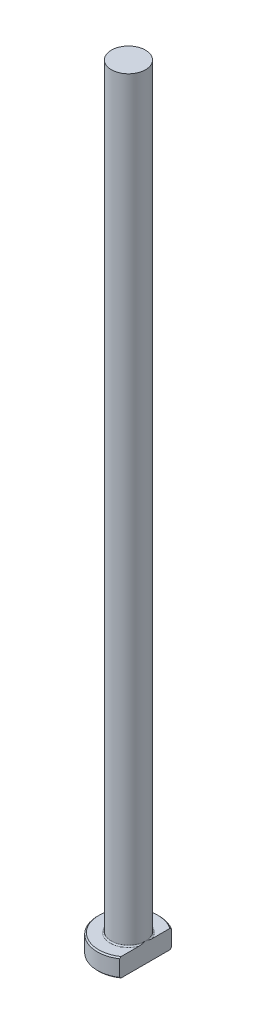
ISO-10303-21;
HEADER;
FILE_DESCRIPTION(('STEP AP214'),'2;1');
FILE_NAME('part.step','',(''),(''),'','','');
FILE_SCHEMA(('AUTOMOTIVE_DESIGN { 1 0 10303 214 1 1 1 1 }'));
ENDSEC;
DATA;
#1=APPLICATION_CONTEXT('core data for automotive mechanical design processes');
#2=APPLICATION_PROTOCOL_DEFINITION('international standard','automotive_design',2000,#1);
#3=PRODUCT_CONTEXT('',#1,'mechanical');
#4=PRODUCT('Part','Part','',(#3));
#5=PRODUCT_RELATED_PRODUCT_CATEGORY('part','',(#4));
#6=PRODUCT_DEFINITION_FORMATION('','',#4);
#7=PRODUCT_DEFINITION_CONTEXT('part definition',#1,'design');
#8=PRODUCT_DEFINITION('design','',#6,#7);
#9=PRODUCT_DEFINITION_SHAPE('','',#8);
#10=(LENGTH_UNIT() NAMED_UNIT(*) SI_UNIT(.MILLI.,.METRE.));
#11=(NAMED_UNIT(*) PLANE_ANGLE_UNIT() SI_UNIT($,.RADIAN.));
#12=(NAMED_UNIT(*) SI_UNIT($,.STERADIAN.) SOLID_ANGLE_UNIT());
#13=UNCERTAINTY_MEASURE_WITH_UNIT(LENGTH_MEASURE(1.E-05),#10,'distance_accuracy_value','');
#14=(GEOMETRIC_REPRESENTATION_CONTEXT(3) GLOBAL_UNCERTAINTY_ASSIGNED_CONTEXT((#13)) GLOBAL_UNIT_ASSIGNED_CONTEXT((#10,
#11,#12)) REPRESENTATION_CONTEXT('',''));
#15=CARTESIAN_POINT('',(0.,0.,0.));
#16=DIRECTION('',(0.,0.,1.));
#17=DIRECTION('',(1.,0.,0.));
#18=AXIS2_PLACEMENT_3D('',#15,#16,#17);
#19=CARTESIAN_POINT('',(0.,0.,0.));
#20=DIRECTION('',(0.,-1.,0.));
#21=DIRECTION('',(0.,0.,-1.));
#22=AXIS2_PLACEMENT_3D('',#19,#20,#21);
#23=PLANE('',#22);
#24=CARTESIAN_POINT('',(0.,0.,0.));
#25=DIRECTION('',(0.,-1.,0.));
#26=DIRECTION('',(0.,0.,-1.));
#27=AXIS2_PLACEMENT_3D('',#24,#25,#26);
#28=CIRCLE('',#27,4.79999999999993);
#29=CARTESIAN_POINT('',(2.74999999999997,0.,3.93414539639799));
#30=VERTEX_POINT('',#29);
#31=CARTESIAN_POINT('',(2.74999999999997,0.,-3.93414539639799));
#32=VERTEX_POINT('',#31);
#33=EDGE_CURVE('E98',#30,#32,#28,.T.);
#34=ORIENTED_EDGE('',*,*,#33,.T.);
#35=DIRECTION('',(0.,0.,1.));
#36=VECTOR('',#35,1.);
#37=CARTESIAN_POINT('',(2.74999999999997,0.,-4.1758232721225));
#38=LINE('',#37,#36);
#39=EDGE_CURVE('E83',#32,#30,#38,.T.);
#40=ORIENTED_EDGE('',*,*,#39,.T.);
#41=EDGE_LOOP('',(#34,#40));
#42=FACE_BOUND('',#41,.T.);
#43=ADVANCED_FACE('F32',(#42),#23,.T.);
#44=CARTESIAN_POINT('',(0.,259.958771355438,0.));
#45=DIRECTION('',(0.,1.,0.));
#46=DIRECTION('',(0.,0.,1.));
#47=AXIS2_PLACEMENT_3D('',#44,#45,#46);
#48=CYLINDRICAL_SURFACE('',#47,4.99999999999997);
#49=CARTESIAN_POINT('',(0.,2.80000000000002,0.));
#50=DIRECTION('',(0.,1.,0.));
#51=DIRECTION('',(0.,0.,1.));
#52=AXIS2_PLACEMENT_3D('',#49,#50,#51);
#53=CIRCLE('',#52,4.99999999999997);
#54=CARTESIAN_POINT('',(2.74999999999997,2.80000000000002,4.1758232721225));
#55=VERTEX_POINT('',#54);
#56=CARTESIAN_POINT('',(2.74999999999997,2.80000000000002,-4.1758232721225));
#57=VERTEX_POINT('',#56);
#58=EDGE_CURVE('E104',#55,#57,#53,.F.);
#59=ORIENTED_EDGE('',*,*,#58,.T.);
#60=DIRECTION('',(0.,-1.,0.));
#61=VECTOR('',#60,1.);
#62=CARTESIAN_POINT('',(2.74999999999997,125.,-4.1758232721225));
#63=LINE('',#62,#61);
#64=CARTESIAN_POINT('',(2.74999999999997,0.200000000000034,-4.1758232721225));
#65=VERTEX_POINT('',#64);
#66=EDGE_CURVE('E183',#57,#65,#63,.T.);
#67=ORIENTED_EDGE('',*,*,#66,.T.);
#68=CARTESIAN_POINT('',(0.,0.200000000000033,0.));
#69=DIRECTION('',(0.,-1.,0.));
#70=DIRECTION('',(0.,0.,-1.));
#71=AXIS2_PLACEMENT_3D('',#68,#69,#70);
#72=CIRCLE('',#71,4.99999999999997);
#73=CARTESIAN_POINT('',(2.74999999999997,0.200000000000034,4.1758232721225));
#74=VERTEX_POINT('',#73);
#75=EDGE_CURVE('E100',#65,#74,#72,.F.);
#76=ORIENTED_EDGE('',*,*,#75,.T.);
#77=DIRECTION('',(0.,-1.,0.));
#78=VECTOR('',#77,1.);
#79=CARTESIAN_POINT('',(2.74999999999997,125.,4.1758232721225));
#80=LINE('',#79,#78);
#81=EDGE_CURVE('E93',#55,#74,#80,.T.);
#82=ORIENTED_EDGE('',*,*,#81,.F.);
#83=EDGE_LOOP('',(#59,#67,#76,#82));
#84=FACE_BOUND('',#83,.T.);
#85=ADVANCED_FACE('F158',(#84),#48,.T.);
#86=CARTESIAN_POINT('',(-4.99999999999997,3.,0.));
#87=DIRECTION('',(0.,1.,0.));
#88=DIRECTION('',(0.,0.,1.));
#89=AXIS2_PLACEMENT_3D('',#86,#87,#88);
#90=PLANE('',#89);
#91=CARTESIAN_POINT('',(0.,3.,0.));
#92=DIRECTION('',(0.,1.,0.));
#93=DIRECTION('',(0.,0.,1.));
#94=AXIS2_PLACEMENT_3D('',#91,#92,#93);
#95=CIRCLE('',#94,4.79999999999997);
#96=CARTESIAN_POINT('',(2.74999999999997,3.,-3.93414539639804));
#97=VERTEX_POINT('',#96);
#98=CARTESIAN_POINT('',(2.74999999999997,3.,3.93414539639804));
#99=VERTEX_POINT('',#98);
#100=EDGE_CURVE('E178',#97,#99,#95,.T.);
#101=ORIENTED_EDGE('',*,*,#100,.T.);
#102=DIRECTION('',(0.,0.,-1.));
#103=VECTOR('',#102,1.);
#104=CARTESIAN_POINT('',(2.74999999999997,3.,0.));
#105=LINE('',#104,#103);
#106=CARTESIAN_POINT('',(2.74999999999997,2.99999999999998,1.06770782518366));
#107=VERTEX_POINT('',#106);
#108=EDGE_CURVE('E57',#99,#107,#105,.T.);
#109=ORIENTED_EDGE('',*,*,#108,.T.);
#110=CARTESIAN_POINT('',(0.,3.,0.));
#111=DIRECTION('',(0.,1.,0.));
#112=DIRECTION('',(0.,0.,1.));
#113=AXIS2_PLACEMENT_3D('',#110,#111,#112);
#114=CIRCLE('',#113,2.94999999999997);
#115=CARTESIAN_POINT('',(2.74999999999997,2.99999999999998,-1.06770782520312));
#116=VERTEX_POINT('',#115);
#117=EDGE_CURVE('E107',#107,#116,#114,.F.);
#118=ORIENTED_EDGE('',*,*,#117,.T.);
#119=EDGE_CURVE('E136',#116,#97,#105,.T.);
#120=ORIENTED_EDGE('',*,*,#119,.T.);
#121=EDGE_LOOP('',(#101,#109,#118,#120));
#122=FACE_BOUND('',#121,.T.);
#123=ADVANCED_FACE('F147',(#122),#90,.T.);
#124=CARTESIAN_POINT('',(0.,3.,0.));
#125=DIRECTION('',(0.,-1.,0.));
#126=DIRECTION('',(0.,0.,-1.));
#127=AXIS2_PLACEMENT_3D('',#124,#125,#126);
#128=CONICAL_SURFACE('',#127,4.79999999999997,0.785398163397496);
#129=ORIENTED_EDGE('',*,*,#58,.F.);
#130=CARTESIAN_POINT('',(2.74999999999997,-1.79114558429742,9.18844783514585));
#131=CARTESIAN_POINT('',(2.74999999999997,-1.62476324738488,9.0147689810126));
#132=CARTESIAN_POINT('',(2.74999999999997,-1.45857819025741,8.84090089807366));
#133=CARTESIAN_POINT('',(2.74999999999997,-1.12668775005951,8.49270511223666));
#134=CARTESIAN_POINT('',(2.74999999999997,-0.960982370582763,8.31837740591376));
#135=CARTESIAN_POINT('',(2.74999999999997,-0.464632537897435,7.79449769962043));
#136=CARTESIAN_POINT('',(2.74999999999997,-0.13483958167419,7.44413786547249));
#137=CARTESIAN_POINT('',(2.74999999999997,0.521406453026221,6.74030951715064));
#138=CARTESIAN_POINT('',(2.74999999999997,0.847859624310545,6.38684108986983));
#139=CARTESIAN_POINT('',(2.74999999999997,1.33353933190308,5.85303151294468));
#140=CARTESIAN_POINT('',(2.74999999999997,1.49475728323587,5.67450358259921));
#141=CARTESIAN_POINT('',(2.74999999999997,1.8154555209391,5.31589537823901));
#142=CARTESIAN_POINT('',(2.74999999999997,1.97493583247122,5.13581512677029));
#143=CARTESIAN_POINT('',(2.74999999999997,2.28246157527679,4.78409714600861));
#144=CARTESIAN_POINT('',(2.74999999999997,2.43063567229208,4.6125721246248));
#145=CARTESIAN_POINT('',(2.74999999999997,2.72427023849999,4.26717959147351));
#146=CARTESIAN_POINT('',(2.74999999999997,2.86973045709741,4.09331186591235));
#147=CARTESIAN_POINT('',(2.74999999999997,3.15716227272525,3.74214491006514));
#148=CARTESIAN_POINT('',(2.74999999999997,3.29912659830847,3.56483970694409));
#149=CARTESIAN_POINT('',(2.74999999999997,3.57763983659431,3.20603939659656));
#150=CARTESIAN_POINT('',(2.74999999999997,3.7141898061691,3.02454511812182));
#151=CARTESIAN_POINT('',(2.74999999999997,3.93857405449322,2.71219163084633));
#152=CARTESIAN_POINT('',(2.74999999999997,4.02851673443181,2.58285434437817));
#153=CARTESIAN_POINT('',(2.74999999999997,4.20308451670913,2.3205424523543));
#154=CARTESIAN_POINT('',(2.74999999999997,4.28770764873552,2.18756652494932));
#155=CARTESIAN_POINT('',(2.74999999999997,4.44931959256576,1.91735675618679));
#156=CARTESIAN_POINT('',(2.74999999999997,4.52632375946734,1.7801322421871));
#157=CARTESIAN_POINT('',(2.74999999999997,4.66966790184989,1.50031327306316));
#158=CARTESIAN_POINT('',(2.74999999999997,4.73601725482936,1.35772367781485));
#159=CARTESIAN_POINT('',(2.74999999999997,4.86065113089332,1.04856386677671));
#160=CARTESIAN_POINT('',(2.74999999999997,4.91700799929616,0.881171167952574));
#161=CARTESIAN_POINT('',(2.74999999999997,4.9810280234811,0.625229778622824));
#162=CARTESIAN_POINT('',(2.74999999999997,4.99893817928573,0.539229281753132));
#163=CARTESIAN_POINT('',(2.74999999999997,5.02707157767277,0.365959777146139));
#164=CARTESIAN_POINT('',(2.74999999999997,5.03729562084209,0.278690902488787));
#165=CARTESIAN_POINT('',(2.74999999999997,5.04949232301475,0.102763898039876));
#166=CARTESIAN_POINT('',(2.74999999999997,5.05138838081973,0.0141003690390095));
#167=CARTESIAN_POINT('',(2.74999999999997,5.04659669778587,-0.16299024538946));
#168=CARTESIAN_POINT('',(2.74999999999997,5.03990892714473,-0.25141732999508));
#169=CARTESIAN_POINT('',(2.74999999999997,5.01835539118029,-0.427430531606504));
#170=CARTESIAN_POINT('',(2.74999999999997,5.00347341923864,-0.51501463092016));
#171=CARTESIAN_POINT('',(2.74999999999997,4.96636720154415,-0.688602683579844));
#172=CARTESIAN_POINT('',(2.74999999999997,4.94414138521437,-0.774606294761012));
#173=CARTESIAN_POINT('',(2.74999999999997,4.88037969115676,-0.988315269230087));
#174=CARTESIAN_POINT('',(2.74999999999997,4.8347849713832,-1.11480587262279));
#175=CARTESIAN_POINT('',(2.74999999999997,4.73271903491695,-1.36329985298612));
#176=CARTESIAN_POINT('',(2.74999999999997,4.67623944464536,-1.48529968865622));
#177=CARTESIAN_POINT('',(2.74999999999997,4.55498227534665,-1.72582737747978));
#178=CARTESIAN_POINT('',(2.74999999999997,4.49016436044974,-1.84433466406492));
#179=CARTESIAN_POINT('',(2.74999999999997,4.38849038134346,-2.01944141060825));
#180=CARTESIAN_POINT('',(2.74999999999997,4.35386385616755,-2.07735876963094));
#181=CARTESIAN_POINT('',(2.74999999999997,4.28331846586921,-2.19239883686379));
#182=CARTESIAN_POINT('',(2.74999999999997,4.24739965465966,-2.24952157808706));
#183=CARTESIAN_POINT('',(2.74999999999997,4.12488368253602,-2.44019263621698));
#184=CARTESIAN_POINT('',(2.74999999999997,4.03574833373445,-2.57211125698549));
#185=CARTESIAN_POINT('',(2.74999999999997,3.85300432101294,-2.83282496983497));
#186=CARTESIAN_POINT('',(2.74999999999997,3.75939460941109,-2.96161931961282));
#187=CARTESIAN_POINT('',(2.74999999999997,3.56878484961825,-3.21681212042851));
#188=CARTESIAN_POINT('',(2.74999999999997,3.47178237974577,-3.34320875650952));
#189=CARTESIAN_POINT('',(2.74999999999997,3.27524323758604,-3.59402090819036));
#190=CARTESIAN_POINT('',(2.74999999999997,3.17570641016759,-3.71843630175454));
#191=CARTESIAN_POINT('',(2.74999999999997,2.97442282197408,-3.96596722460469));
#192=CARTESIAN_POINT('',(2.74999999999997,2.87267126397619,-4.08907884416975));
#193=CARTESIAN_POINT('',(2.74999999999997,2.66760125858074,-4.3339916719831));
#194=CARTESIAN_POINT('',(2.74999999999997,2.56428277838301,-4.45579285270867));
#195=CARTESIAN_POINT('',(2.74999999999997,2.25255029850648,-4.81947940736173));
#196=CARTESIAN_POINT('',(2.74999999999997,2.04226620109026,-5.05976099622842));
#197=CARTESIAN_POINT('',(2.74999999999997,1.61812846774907,-5.5376054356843));
#198=CARTESIAN_POINT('',(2.74999999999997,1.40427119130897,-5.77516503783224));
#199=CARTESIAN_POINT('',(2.74999999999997,0.974157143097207,-6.24814387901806));
#200=CARTESIAN_POINT('',(2.74999999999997,0.757900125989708,-6.48356289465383));
#201=CARTESIAN_POINT('',(2.74999999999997,0.323911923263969,-6.95249982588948));
#202=CARTESIAN_POINT('',(2.74999999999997,0.106182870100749,-7.186019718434));
#203=CARTESIAN_POINT('',(2.74999999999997,-0.330587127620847,-7.65182952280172));
#204=CARTESIAN_POINT('',(2.74999999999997,-0.549628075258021,-7.88411943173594));
#205=CARTESIAN_POINT('',(2.74999999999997,-0.854135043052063,-8.20563072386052));
#206=CARTESIAN_POINT('',(2.74999999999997,-0.939169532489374,-8.29526139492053));
#207=CARTESIAN_POINT('',(2.74999999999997,-1.10939110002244,-8.47440444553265));
#208=CARTESIAN_POINT('',(2.74999999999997,-1.19457819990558,-8.56391680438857));
#209=CARTESIAN_POINT('',(2.74999999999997,-1.36493542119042,-8.74266965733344));
#210=CARTESIAN_POINT('',(2.74999999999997,-1.45010532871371,-8.83191035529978));
#211=CARTESIAN_POINT('',(2.74999999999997,-1.62054776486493,-9.01026683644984));
#212=CARTESIAN_POINT('',(2.74999999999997,-1.70582027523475,-9.09938263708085));
#213=CARTESIAN_POINT('',(2.74999999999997,-1.79114558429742,-9.18844783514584));
#214=B_SPLINE_CURVE_WITH_KNOTS('',3,(#130,#131,#132,#133,#134,#135,#136,#137,#138,#139,#140,
#141,#142,#143,#144,#145,#146,#147,#148,#149,#150,#151,#152,#153,#154,#155,#156,#157,#158,#159,
#160,#161,#162,#163,#164,#165,#166,#167,#168,#169,#170,#171,#172,#173,#174,#175,#176,#177,#178,
#179,#180,#181,#182,#183,#184,#185,#186,#187,#188,#189,#190,#191,#192,#193,#194,#195,#196,#197,
#198,#199,#200,#201,#202,#203,#204,#205,#206,#207,#208,#209,#210,#211,#212,#213),.UNSPECIFIED.,
.F.,.F.,(4,2,2,2,2,2,2,2,2,2,2,2,2,2,2,2,2,2,2,2,2,2,2,2,2,2,2,2,2,2,2,2,2,2,2,2,2,2,2,2,2,4),
(0.,0.721544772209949,1.4430949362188,2.88656432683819,4.32999349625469,5.05163004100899,
5.77325612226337,6.45322671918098,7.13325979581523,7.81460476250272,8.49581607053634,
8.96833065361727,9.4410192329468,9.91273488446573,10.3840330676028,10.9119743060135,
11.1752192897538,11.4384368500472,11.7040704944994,11.9697050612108,12.2358669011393,
12.5020857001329,12.9047274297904,13.3076801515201,13.712661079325,13.9150857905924,
14.1175020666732,14.5949844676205,15.0725792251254,15.5505221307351,16.0284943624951,
16.5076321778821,16.9867800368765,17.94463622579,18.9035363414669,19.862535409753,
20.8203587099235,21.7781842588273,22.1488332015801,22.5195401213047,22.889621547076,
23.259644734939),.UNSPECIFIED.);
#215=EDGE_CURVE('E135',#55,#99,#214,.T.);
#216=ORIENTED_EDGE('',*,*,#215,.T.);
#217=ORIENTED_EDGE('',*,*,#100,.F.);
#218=EDGE_CURVE('E127',#97,#57,#214,.T.);
#219=ORIENTED_EDGE('',*,*,#218,.T.);
#220=EDGE_LOOP('',(#129,#216,#217,#219));
#221=FACE_BOUND('',#220,.T.);
#222=ADVANCED_FACE('F143',(#221),#128,.T.);
#223=CARTESIAN_POINT('',(0.,0.200000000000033,0.));
#224=DIRECTION('',(0.,1.,0.));
#225=DIRECTION('',(0.,0.,1.));
#226=AXIS2_PLACEMENT_3D('',#223,#224,#225);
#227=CONICAL_SURFACE('',#226,4.99999999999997,0.785398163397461);
#228=ORIENTED_EDGE('',*,*,#75,.F.);
#229=CARTESIAN_POINT('',(2.74999999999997,4.7911455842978,-9.18844783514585));
#230=CARTESIAN_POINT('',(2.74999999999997,4.62476324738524,-9.0147689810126));
#231=CARTESIAN_POINT('',(2.74999999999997,4.45857819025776,-8.84090089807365));
#232=CARTESIAN_POINT('',(2.74999999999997,4.12668775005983,-8.49270511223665));
#233=CARTESIAN_POINT('',(2.74999999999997,3.96098237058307,-8.31837740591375));
#234=CARTESIAN_POINT('',(2.74999999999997,3.4646325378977,-7.79449769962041));
#235=CARTESIAN_POINT('',(2.74999999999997,3.13483958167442,-7.44413786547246));
#236=CARTESIAN_POINT('',(2.74999999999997,2.47859354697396,-6.7403095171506));
#237=CARTESIAN_POINT('',(2.74999999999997,2.15214037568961,-6.38684108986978));
#238=CARTESIAN_POINT('',(2.74999999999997,1.66646066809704,-5.85303151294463));
#239=CARTESIAN_POINT('',(2.74999999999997,1.50524271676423,-5.67450358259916));
#240=CARTESIAN_POINT('',(2.74999999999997,1.18454447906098,-5.31589537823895));
#241=CARTESIAN_POINT('',(2.74999999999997,1.02506416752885,-5.13581512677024));
#242=CARTESIAN_POINT('',(2.74999999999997,0.717538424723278,-4.78409714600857));
#243=CARTESIAN_POINT('',(2.74999999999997,0.569364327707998,-4.6125721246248));
#244=CARTESIAN_POINT('',(2.74999999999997,0.275729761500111,-4.26717959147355));
#245=CARTESIAN_POINT('',(2.74999999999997,0.130269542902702,-4.09331186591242));
#246=CARTESIAN_POINT('',(2.74999999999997,-0.157162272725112,-3.74214491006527));
#247=CARTESIAN_POINT('',(2.74999999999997,-0.299126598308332,-3.56483970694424));
#248=CARTESIAN_POINT('',(2.74999999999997,-0.577639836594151,-3.20603939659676));
#249=CARTESIAN_POINT('',(2.74999999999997,-0.714189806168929,-3.02454511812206));
#250=CARTESIAN_POINT('',(2.74999999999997,-0.93857405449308,-2.71219163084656));
#251=CARTESIAN_POINT('',(2.74999999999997,-1.02851673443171,-2.58285434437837));
#252=CARTESIAN_POINT('',(2.74999999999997,-1.20308451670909,-2.32054245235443));
#253=CARTESIAN_POINT('',(2.74999999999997,-1.2877076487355,-2.18756652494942));
#254=CARTESIAN_POINT('',(2.74999999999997,-1.4493195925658,-1.91735675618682));
#255=CARTESIAN_POINT('',(2.74999999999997,-1.52632375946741,-1.78013224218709));
#256=CARTESIAN_POINT('',(2.74999999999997,-1.66966790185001,-1.50031327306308));
#257=CARTESIAN_POINT('',(2.74999999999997,-1.73601725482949,-1.35772367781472));
#258=CARTESIAN_POINT('',(2.74999999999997,-1.86065113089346,-1.04856386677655));
#259=CARTESIAN_POINT('',(2.74999999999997,-1.91700799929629,-0.881171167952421));
#260=CARTESIAN_POINT('',(2.74999999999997,-1.98102802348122,-0.625229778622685));
#261=CARTESIAN_POINT('',(2.74999999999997,-1.99893817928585,-0.539229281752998));
#262=CARTESIAN_POINT('',(2.74999999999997,-2.02707157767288,-0.365959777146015));
#263=CARTESIAN_POINT('',(2.74999999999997,-2.0372956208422,-0.278690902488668));
#264=CARTESIAN_POINT('',(2.74999999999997,-2.04949232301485,-0.102763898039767));
#265=CARTESIAN_POINT('',(2.74999999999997,-2.05138838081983,-0.0141003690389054));
#266=CARTESIAN_POINT('',(2.74999999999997,-2.04659669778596,0.162990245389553));
#267=CARTESIAN_POINT('',(2.74999999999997,-2.03990892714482,0.251417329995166));
#268=CARTESIAN_POINT('',(2.74999999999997,-2.01835539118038,0.427430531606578));
#269=CARTESIAN_POINT('',(2.74999999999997,-2.00347341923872,0.515014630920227));
#270=CARTESIAN_POINT('',(2.74999999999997,-1.96636720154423,0.688602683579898));
#271=CARTESIAN_POINT('',(2.74999999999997,-1.94414138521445,0.77460629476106));
#272=CARTESIAN_POINT('',(2.74999999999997,-1.88037969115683,0.988315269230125));
#273=CARTESIAN_POINT('',(2.74999999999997,-1.83478497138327,1.11480587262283));
#274=CARTESIAN_POINT('',(2.74999999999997,-1.73271903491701,1.36329985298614));
#275=CARTESIAN_POINT('',(2.74999999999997,-1.67623944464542,1.48529968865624));
#276=CARTESIAN_POINT('',(2.74999999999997,-1.55498227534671,1.72582737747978));
#277=CARTESIAN_POINT('',(2.74999999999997,-1.4901643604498,1.84433466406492));
#278=CARTESIAN_POINT('',(2.74999999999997,-1.38849038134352,2.01944141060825));
#279=CARTESIAN_POINT('',(2.74999999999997,-1.3538638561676,2.07735876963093));
#280=CARTESIAN_POINT('',(2.74999999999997,-1.28331846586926,2.19239883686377));
#281=CARTESIAN_POINT('',(2.74999999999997,-1.24739965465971,2.24952157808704));
#282=CARTESIAN_POINT('',(2.74999999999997,-1.12488368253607,2.44019263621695));
#283=CARTESIAN_POINT('',(2.74999999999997,-1.0357483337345,2.57211125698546));
#284=CARTESIAN_POINT('',(2.74999999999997,-0.85300432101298,2.83282496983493));
#285=CARTESIAN_POINT('',(2.74999999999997,-0.759394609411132,2.96161931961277));
#286=CARTESIAN_POINT('',(2.74999999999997,-0.568784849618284,3.21681212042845));
#287=CARTESIAN_POINT('',(2.74999999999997,-0.47178237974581,3.34320875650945));
#288=CARTESIAN_POINT('',(2.74999999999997,-0.275243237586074,3.59402090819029));
#289=CARTESIAN_POINT('',(2.74999999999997,-0.17570641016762,3.71843630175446));
#290=CARTESIAN_POINT('',(2.74999999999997,0.0255771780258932,3.9659672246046));
#291=CARTESIAN_POINT('',(2.74999999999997,0.127328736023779,4.08907884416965));
#292=CARTESIAN_POINT('',(2.74999999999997,0.33239874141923,4.33399167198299));
#293=CARTESIAN_POINT('',(2.74999999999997,0.435717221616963,4.45579285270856));
#294=CARTESIAN_POINT('',(2.74999999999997,0.747449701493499,4.8194794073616));
#295=CARTESIAN_POINT('',(2.74999999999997,0.95773379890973,5.05976099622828));
#296=CARTESIAN_POINT('',(2.74999999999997,1.38187153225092,5.53760543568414));
#297=CARTESIAN_POINT('',(2.74999999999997,1.59572880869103,5.77516503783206));
#298=CARTESIAN_POINT('',(2.74999999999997,2.02584285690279,6.24814387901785));
#299=CARTESIAN_POINT('',(2.74999999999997,2.2420998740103,6.48356289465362));
#300=CARTESIAN_POINT('',(2.74999999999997,2.67608807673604,6.95249982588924));
#301=CARTESIAN_POINT('',(2.74999999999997,2.89381712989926,7.18601971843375));
#302=CARTESIAN_POINT('',(2.74999999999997,3.33058712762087,7.65182952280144));
#303=CARTESIAN_POINT('',(2.74999999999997,3.54962807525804,7.88411943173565));
#304=CARTESIAN_POINT('',(2.74999999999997,3.85413504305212,8.20563072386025));
#305=CARTESIAN_POINT('',(2.74999999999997,3.93916953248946,8.29526139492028));
#306=CARTESIAN_POINT('',(2.74999999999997,4.10939110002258,8.47440444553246));
#307=CARTESIAN_POINT('',(2.74999999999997,4.19457819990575,8.5639168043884));
#308=CARTESIAN_POINT('',(2.74999999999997,4.36493542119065,8.74266965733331));
#309=CARTESIAN_POINT('',(2.74999999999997,4.45010532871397,8.83191035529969));
#310=CARTESIAN_POINT('',(2.74999999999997,4.62054776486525,9.0102668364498));
#311=CARTESIAN_POINT('',(2.74999999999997,4.7058202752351,9.09938263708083));
#312=CARTESIAN_POINT('',(2.74999999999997,4.7911455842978,9.18844783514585));
#313=B_SPLINE_CURVE_WITH_KNOTS('',3,(#229,#230,#231,#232,#233,#234,#235,#236,#237,#238,#239,
#240,#241,#242,#243,#244,#245,#246,#247,#248,#249,#250,#251,#252,#253,#254,#255,#256,#257,#258,
#259,#260,#261,#262,#263,#264,#265,#266,#267,#268,#269,#270,#271,#272,#273,#274,#275,#276,#277,
#278,#279,#280,#281,#282,#283,#284,#285,#286,#287,#288,#289,#290,#291,#292,#293,#294,#295,#296,
#297,#298,#299,#300,#301,#302,#303,#304,#305,#306,#307,#308,#309,#310,#311,#312),.UNSPECIFIED.,
.F.,.F.,(4,2,2,2,2,2,2,2,2,2,2,2,2,2,2,2,2,2,2,2,2,2,2,2,2,2,2,2,2,2,2,2,2,2,2,2,2,2,2,2,2,4),
(0.,0.721544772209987,1.44309493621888,2.88656432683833,4.32999349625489,5.05163004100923,
5.77325612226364,6.45322671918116,7.13325979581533,7.81460476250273,8.49581607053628,
8.96833065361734,9.44101923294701,9.91273488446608,10.3840330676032,10.911974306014,
11.1752192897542,11.4384368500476,11.7040704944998,11.9697050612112,12.2358669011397,
12.5020857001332,12.9047274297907,13.3076801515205,13.7126610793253,13.9150857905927,
14.1175020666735,14.5949844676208,15.0725792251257,15.5505221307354,16.0284943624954,
16.5076321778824,16.9867800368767,17.9446362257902,18.9035363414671,19.8625354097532,
20.8203587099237,21.7781842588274,22.1488332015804,22.5195401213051,22.8896215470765,
23.2596447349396),.UNSPECIFIED.);
#314=EDGE_CURVE('E86',#65,#32,#313,.T.);
#315=ORIENTED_EDGE('',*,*,#314,.T.);
#316=ORIENTED_EDGE('',*,*,#33,.F.);
#317=EDGE_CURVE('E89',#30,#74,#313,.T.);
#318=ORIENTED_EDGE('',*,*,#317,.T.);
#319=EDGE_LOOP('',(#228,#315,#316,#318));
#320=FACE_BOUND('',#319,.T.);
#321=ADVANCED_FACE('F97',(#320),#227,.T.);
#322=CARTESIAN_POINT('',(0.,3.19999999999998,0.));
#323=DIRECTION('',(0.,1.,0.));
#324=DIRECTION('',(0.,0.,1.));
#325=AXIS2_PLACEMENT_3D('',#322,#323,#324);
#326=TOROIDAL_SURFACE('',#325,2.94999999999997,0.2);
#327=CARTESIAN_POINT('',(2.74999999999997,3.19999999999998,0.));
#328=CARTESIAN_POINT('',(2.74999999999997,3.20000050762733,1.12997179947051E-10));
#329=CARTESIAN_POINT('',(2.74999999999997,3.20000101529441,-1.81527532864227E-07));
#330=CARTESIAN_POINT('',(2.74999999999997,3.20000196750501,-6.94840309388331E-07));
#331=CARTESIAN_POINT('',(2.74999999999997,3.20000240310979,-1.03787717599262E-06));
#332=CARTESIAN_POINT('',(2.74999999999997,3.20000330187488,-1.85808127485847E-06));
#333=CARTESIAN_POINT('',(2.74999999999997,3.20000375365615,-2.34835981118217E-06));
#334=CARTESIAN_POINT('',(2.74999999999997,3.20000456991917,-3.3704695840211E-06));
#335=CARTESIAN_POINT('',(2.74999999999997,3.20000493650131,-3.90074158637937E-06));
#336=CARTESIAN_POINT('',(2.74999999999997,3.20000627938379,-5.9326172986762E-06));
#337=CARTESIAN_POINT('',(2.74999999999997,3.20000718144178,-7.48563172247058E-06));
#338=CARTESIAN_POINT('',(2.74999999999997,3.20000868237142,-1.0579008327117E-05));
#339=CARTESIAN_POINT('',(2.74999999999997,3.20000929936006,-1.21109700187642E-05));
#340=CARTESIAN_POINT('',(2.74999999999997,3.2000118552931,-1.85322192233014E-05));
#341=CARTESIAN_POINT('',(2.74999999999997,3.20001373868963,-2.34472711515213E-05));
#342=CARTESIAN_POINT('',(2.74999999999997,3.20001654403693,-3.27779451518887E-05));
#343=CARTESIAN_POINT('',(2.74999999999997,3.20001756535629,-3.71636222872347E-05));
#344=CARTESIAN_POINT('',(2.74999999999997,3.20002495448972,-6.95743732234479E-05));
#345=CARTESIAN_POINT('',(2.74999999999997,3.20003050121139,-9.77394523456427E-05));
#346=CARTESIAN_POINT('',(2.74999999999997,3.20005478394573,-0.000208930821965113));
#347=CARTESIAN_POINT('',(2.74999999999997,3.2000780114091,-0.000290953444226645));
#348=CARTESIAN_POINT('',(2.74999999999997,3.20016837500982,-0.000615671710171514));
#349=CARTESIAN_POINT('',(2.74999999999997,3.20023256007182,-0.0008589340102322));
#350=CARTESIAN_POINT('',(2.74999999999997,3.20048946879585,-0.00182516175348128));
#351=CARTESIAN_POINT('',(2.74999999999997,3.20068588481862,-0.00254739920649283));
#352=CARTESIAN_POINT('',(2.74999999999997,3.20150145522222,-0.0055546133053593));
#353=CARTESIAN_POINT('',(2.74999999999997,3.20211597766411,-0.00784050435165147));
#354=CARTESIAN_POINT('',(2.74999999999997,3.20754641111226,-0.0280301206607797));
#355=CARTESIAN_POINT('',(2.74999999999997,3.2123805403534,-0.0459303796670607));
#356=CARTESIAN_POINT('',(2.74999999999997,3.22182435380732,-0.081029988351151));
#357=CARTESIAN_POINT('',(2.74999999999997,3.226435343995,-0.0982290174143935));
#358=CARTESIAN_POINT('',(2.74999999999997,3.23620184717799,-0.134808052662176));
#359=CARTESIAN_POINT('',(2.74999999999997,3.24135263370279,-0.154189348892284));
#360=CARTESIAN_POINT('',(2.74999999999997,3.25163624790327,-0.193181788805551));
#361=CARTESIAN_POINT('',(2.74999999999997,3.25676827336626,-0.21279314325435));
#362=CARTESIAN_POINT('',(2.74999999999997,3.26905119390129,-0.260223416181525));
#363=CARTESIAN_POINT('',(2.74999999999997,3.27615177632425,-0.288055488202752));
#364=CARTESIAN_POINT('',(2.74999999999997,3.28988618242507,-0.343037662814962));
#365=CARTESIAN_POINT('',(2.74999999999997,3.29652742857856,-0.370185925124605));
#366=CARTESIAN_POINT('',(2.74999999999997,3.3179119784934,-0.460013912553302));
#367=CARTESIAN_POINT('',(2.74999999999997,3.33192996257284,-0.522872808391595));
#368=CARTESIAN_POINT('',(2.74999999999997,3.35724782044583,-0.649858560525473));
#369=CARTESIAN_POINT('',(2.74999999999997,3.36851625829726,-0.713991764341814));
#370=CARTESIAN_POINT('',(2.74999999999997,3.38744836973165,-0.848144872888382));
#371=CARTESIAN_POINT('',(2.74999999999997,3.39474814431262,-0.918222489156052));
#372=CARTESIAN_POINT('',(2.74999999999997,3.39971832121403,-1.02344881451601));
#373=CARTESIAN_POINT('',(2.74999999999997,3.40038441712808,-1.05845158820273));
#374=CARTESIAN_POINT('',(2.74999999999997,3.39917295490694,-1.12840448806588));
#375=CARTESIAN_POINT('',(2.74999999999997,3.39729798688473,-1.16335463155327));
#376=CARTESIAN_POINT('',(2.74999999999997,3.39199994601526,-1.21505383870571));
#377=CARTESIAN_POINT('',(2.74999999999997,3.38986571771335,-1.23193598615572));
#378=CARTESIAN_POINT('',(2.74999999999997,3.38464996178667,-1.26557152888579));
#379=CARTESIAN_POINT('',(2.74999999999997,3.38156766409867,-1.28232480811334));
#380=CARTESIAN_POINT('',(2.74999999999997,3.37431364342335,-1.31540767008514));
#381=CARTESIAN_POINT('',(2.74999999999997,3.37015411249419,-1.33173987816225));
#382=CARTESIAN_POINT('',(2.74999999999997,3.36048976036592,-1.36399299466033));
#383=CARTESIAN_POINT('',(2.74999999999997,3.35498646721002,-1.37991434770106));
#384=CARTESIAN_POINT('',(2.74999999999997,3.34222746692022,-1.41123903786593));
#385=CARTESIAN_POINT('',(2.74999999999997,3.33495457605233,-1.42663549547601));
#386=CARTESIAN_POINT('',(2.74999999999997,3.318175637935,-1.45617471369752));
#387=CARTESIAN_POINT('',(2.74999999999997,3.30867792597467,-1.4703218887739));
#388=CARTESIAN_POINT('',(2.74999999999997,3.29277007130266,-1.48907990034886));
#389=CARTESIAN_POINT('',(2.74999999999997,3.2875192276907,-1.49466894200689));
#390=CARTESIAN_POINT('',(2.74999999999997,3.27634440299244,-1.50515028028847));
#391=CARTESIAN_POINT('',(2.74999999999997,3.27042002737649,-1.51004216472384));
#392=CARTESIAN_POINT('',(2.74999999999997,3.25778482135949,-1.51891099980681));
#393=CARTESIAN_POINT('',(2.74999999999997,3.2510643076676,-1.52287446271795));
#394=CARTESIAN_POINT('',(2.74999999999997,3.23698143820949,-1.5294174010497));
#395=CARTESIAN_POINT('',(2.74999999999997,3.22962116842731,-1.53200119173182));
#396=CARTESIAN_POINT('',(2.74999999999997,3.2166326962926,-1.53496289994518));
#397=CARTESIAN_POINT('',(2.74999999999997,3.2110985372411,-1.53575651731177));
#398=CARTESIAN_POINT('',(2.74999999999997,3.19997558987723,-1.53638738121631));
#399=CARTESIAN_POINT('',(2.74999999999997,3.19438682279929,-1.53622498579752));
#400=CARTESIAN_POINT('',(2.74999999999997,3.18332943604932,-1.53495937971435));
#401=CARTESIAN_POINT('',(2.74999999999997,3.17786061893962,-1.53385785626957));
#402=CARTESIAN_POINT('',(2.74999999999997,3.16716525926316,-1.53080991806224));
#403=CARTESIAN_POINT('',(2.74999999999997,3.16193889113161,-1.52886290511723));
#404=CARTESIAN_POINT('',(2.74999999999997,3.14983366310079,-1.52335528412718));
#405=CARTESIAN_POINT('',(2.74999999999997,3.14310699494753,-1.51946144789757));
#406=CARTESIAN_POINT('',(2.74999999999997,3.13035821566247,-1.51065443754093));
#407=CARTESIAN_POINT('',(2.74999999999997,3.12433789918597,-1.50573875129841));
#408=CARTESIAN_POINT('',(2.74999999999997,3.10956608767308,-1.4920109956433));
#409=CARTESIAN_POINT('',(2.74999999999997,3.10134587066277,-1.48263193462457));
#410=CARTESIAN_POINT('',(2.74999999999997,3.08638427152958,-1.46278796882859));
#411=CARTESIAN_POINT('',(2.74999999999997,3.07964511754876,-1.45232146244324));
#412=CARTESIAN_POINT('',(2.74999999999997,3.06171675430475,-1.42080727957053));
#413=CARTESIAN_POINT('',(2.74999999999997,3.05211924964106,-1.39886385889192));
#414=CARTESIAN_POINT('',(2.74999999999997,3.03592584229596,-1.35377597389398));
#415=CARTESIAN_POINT('',(2.74999999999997,3.02935693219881,-1.33062268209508));
#416=CARTESIAN_POINT('',(2.74999999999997,3.01641276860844,-1.27469229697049));
#417=CARTESIAN_POINT('',(2.74999999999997,3.01110503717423,-1.24167224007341));
#418=CARTESIAN_POINT('',(2.74999999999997,3.00364182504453,-1.17522319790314));
#419=CARTESIAN_POINT('',(2.74999999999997,3.00149608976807,-1.14179326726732));
#420=CARTESIAN_POINT('',(2.74999999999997,2.99965905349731,-1.0761846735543));
#421=CARTESIAN_POINT('',(2.74999999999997,2.9998750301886,-1.04400821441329));
#422=CARTESIAN_POINT('',(2.74999999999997,3.00208041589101,-0.979705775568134));
#423=CARTESIAN_POINT('',(2.74999999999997,3.00407086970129,-0.94757983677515));
#424=CARTESIAN_POINT('',(2.74999999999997,3.01231998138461,-0.849711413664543));
#425=CARTESIAN_POINT('',(2.74999999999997,3.02086596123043,-0.784164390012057));
#426=CARTESIAN_POINT('',(2.74999999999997,3.04217753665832,-0.652153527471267));
#427=CARTESIAN_POINT('',(2.74999999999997,3.05504187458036,-0.585706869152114));
#428=CARTESIAN_POINT('',(2.74999999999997,3.07899589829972,-0.474257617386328));
#429=CARTESIAN_POINT('',(2.74999999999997,3.08936705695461,-0.429096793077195));
#430=CARTESIAN_POINT('',(2.74999999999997,3.11088695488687,-0.339494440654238));
#431=CARTESIAN_POINT('',(2.74999999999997,3.12202574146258,-0.295050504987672));
#432=CARTESIAN_POINT('',(2.74999999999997,3.14355229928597,-0.211341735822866));
#433=CARTESIAN_POINT('',(2.74999999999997,3.15388178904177,-0.17206169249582));
#434=CARTESIAN_POINT('',(2.74999999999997,3.17523671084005,-0.0918970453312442));
#435=CARTESIAN_POINT('',(2.74999999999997,3.18627305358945,-0.0510152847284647));
#436=CARTESIAN_POINT('',(2.74999999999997,3.19788514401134,-0.00783595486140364));
#437=CARTESIAN_POINT('',(2.74999999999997,3.19850096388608,-0.00554554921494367));
#438=CARTESIAN_POINT('',(2.74999999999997,3.19931683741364,-0.00253730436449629));
#439=CARTESIAN_POINT('',(2.74999999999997,3.19951229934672,-0.00181855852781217));
#440=CARTESIAN_POINT('',(2.74999999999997,3.19976804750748,-0.000856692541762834));
#441=CARTESIAN_POINT('',(2.74999999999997,3.19983200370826,-0.000614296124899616));
#442=CARTESIAN_POINT('',(2.74999999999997,3.19992209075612,-0.000290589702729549));
#443=CARTESIAN_POINT('',(2.74999999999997,3.19994527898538,-0.000208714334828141));
#444=CARTESIAN_POINT('',(2.74999999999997,3.19996952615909,-9.76928428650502E-05));
#445=CARTESIAN_POINT('',(2.74999999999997,3.19997506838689,-6.95486157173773E-05));
#446=CARTESIAN_POINT('',(2.74999999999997,3.19998244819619,-3.71590915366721E-05));
#447=CARTESIAN_POINT('',(2.74999999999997,3.1999834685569,-3.2774592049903E-05));
#448=CARTESIAN_POINT('',(2.74999999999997,3.19998627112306,-2.34463157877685E-05));
#449=CARTESIAN_POINT('',(2.74999999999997,3.19998815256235,-1.85324214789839E-05));
#450=CARTESIAN_POINT('',(2.74999999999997,3.19999070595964,-1.21123670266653E-05));
#451=CARTESIAN_POINT('',(2.74999999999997,3.19999132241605,-1.05804935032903E-05));
#452=CARTESIAN_POINT('',(2.74999999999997,3.1999928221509,-7.4872040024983E-06));
#453=CARTESIAN_POINT('',(2.74999999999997,3.19999372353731,-5.93417784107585E-06));
#454=CARTESIAN_POINT('',(2.74999999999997,3.19999506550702,-3.90218205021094E-06));
#455=CARTESIAN_POINT('',(2.74999999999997,3.19999543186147,-3.37184999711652E-06));
#456=CARTESIAN_POINT('',(2.74999999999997,3.19999624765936,-2.3495790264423E-06));
#457=CARTESIAN_POINT('',(2.74999999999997,3.1999966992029,-1.85919798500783E-06));
#458=CARTESIAN_POINT('',(2.74999999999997,3.19999759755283,-1.03875218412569E-06));
#459=CARTESIAN_POINT('',(2.74999999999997,3.19999803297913,-6.95584891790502E-07));
#460=CARTESIAN_POINT('',(2.74999999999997,3.19999898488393,-1.81944076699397E-07));
#461=CARTESIAN_POINT('',(2.74999999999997,3.1999994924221,-1.12986168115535E-10));
#462=CARTESIAN_POINT('',(2.74999999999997,3.19999999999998,0.));
#463=B_SPLINE_CURVE_WITH_KNOTS('',3,(#327,#328,#329,#330,#331,#332,#333,#334,#335,#336,#337,
#338,#339,#340,#341,#342,#343,#344,#345,#346,#347,#348,#349,#350,#351,#352,#353,#354,#355,#356,
#357,#358,#359,#360,#361,#362,#363,#364,#365,#366,#367,#368,#369,#370,#371,#372,#373,#374,#375,
#376,#377,#378,#379,#380,#381,#382,#383,#384,#385,#386,#387,#388,#389,#390,#391,#392,#393,#394,
#395,#396,#397,#398,#399,#400,#401,#402,#403,#404,#405,#406,#407,#408,#409,#410,#411,#412,#413,
#414,#415,#416,#417,#418,#419,#420,#421,#422,#423,#424,#425,#426,#427,#428,#429,#430,#431,#432,
#433,#434,#435,#436,#437,#438,#439,#440,#441,#442,#443,#444,#445,#446,#447,#448,#449,#450,#451,
#452,#453,#454,#455,#456,#457,#458,#459,#460,#461,#462),.UNSPECIFIED.,.T.,.F.,(4,2,2,2,2,2,2,2,
2,2,2,2,2,2,2,2,2,2,2,2,2,2,2,2,2,2,2,2,2,2,2,2,2,2,2,2,2,2,2,2,2,2,2,2,2,2,2,2,2,2,2,2,2,2,2,2,
2,2,2,2,2,2,2,2,2,2,2,4),(0.,1.53302763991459E-06,3.19538931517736E-06,5.18410400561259E-06,
7.11680710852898E-06,1.24843266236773E-05,1.74346122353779E-05,3.3195428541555E-05,
4.66876455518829E-05,0.000132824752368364,0.000388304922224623,0.00114333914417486,
0.0033884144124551,0.0104899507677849,0.0661127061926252,0.119532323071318,0.179694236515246,
0.240509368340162,0.326678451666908,0.410524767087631,0.603684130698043,0.798958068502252,
1.00997653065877,1.11494231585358,1.21980118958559,1.27083021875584,1.32190080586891,
1.37241688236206,1.42287578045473,1.4738457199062,1.52462767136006,1.54758745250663,
1.57056075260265,1.59384955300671,1.61706507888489,1.6337610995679,1.65045086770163,
1.66711071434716,1.68378236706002,1.70696786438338,1.73021104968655,1.76741395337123,
1.80467244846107,1.87612299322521,1.94819858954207,2.0482867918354,2.14868283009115,
2.24515187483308,2.34167775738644,2.53976637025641,2.74273377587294,2.88173187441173,
3.01918106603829,3.14102752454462,3.268058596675,3.27517420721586,3.27740842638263,
3.27816077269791,3.27841579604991,3.27850186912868,3.27851535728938,3.27853111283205,
3.27853606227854,3.27854142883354,3.27854336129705,3.27854534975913,3.27854701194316,
3.2785485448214),.UNSPECIFIED.);
#464=CARTESIAN_POINT('',(2.74999999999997,3.19999999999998,0.));
#465=VERTEX_POINT('',#464);
#466=EDGE_CURVE('E11',#116,#465,#463,.T.);
#467=ORIENTED_EDGE('',*,*,#466,.F.);
#468=ORIENTED_EDGE('',*,*,#117,.F.);
#469=CARTESIAN_POINT('',(2.74999999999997,3.19999999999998,0.));
#470=CARTESIAN_POINT('',(2.74999999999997,3.19999949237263,-1.12997235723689E-10));
#471=CARTESIAN_POINT('',(2.74999999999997,3.19999898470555,1.8152753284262E-07));
#472=CARTESIAN_POINT('',(2.74999999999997,3.19999803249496,6.94840309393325E-07));
#473=CARTESIAN_POINT('',(2.74999999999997,3.19999759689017,1.03787717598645E-06));
#474=CARTESIAN_POINT('',(2.74999999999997,3.19999669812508,1.85808127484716E-06));
#475=CARTESIAN_POINT('',(2.74999999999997,3.19999624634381,2.34835981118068E-06));
#476=CARTESIAN_POINT('',(2.74999999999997,3.19999543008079,3.37046958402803E-06));
#477=CARTESIAN_POINT('',(2.74999999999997,3.19999506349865,3.90074158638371E-06));
#478=CARTESIAN_POINT('',(2.74999999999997,3.19999372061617,5.93261729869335E-06));
#479=CARTESIAN_POINT('',(2.74999999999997,3.19999281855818,7.48563172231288E-06));
#480=CARTESIAN_POINT('',(2.74999999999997,3.19999131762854,1.05790083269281E-05));
#481=CARTESIAN_POINT('',(2.74999999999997,3.1999907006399,1.21109700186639E-05));
#482=CARTESIAN_POINT('',(2.74999999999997,3.19998814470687,1.85322192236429E-05));
#483=CARTESIAN_POINT('',(2.74999999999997,3.19998626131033,2.34472711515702E-05));
#484=CARTESIAN_POINT('',(2.74999999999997,3.19998345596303,3.27779451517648E-05));
#485=CARTESIAN_POINT('',(2.74999999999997,3.19998243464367,3.71636222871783E-05));
#486=CARTESIAN_POINT('',(2.74999999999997,3.19997504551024,6.95743732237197E-05));
#487=CARTESIAN_POINT('',(2.74999999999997,3.19996949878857,9.77394523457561E-05));
#488=CARTESIAN_POINT('',(2.74999999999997,3.19994521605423,0.000208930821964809));
#489=CARTESIAN_POINT('',(2.74999999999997,3.19992198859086,0.000290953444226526));
#490=CARTESIAN_POINT('',(2.74999999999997,3.19983162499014,0.000615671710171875));
#491=CARTESIAN_POINT('',(2.74999999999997,3.19976743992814,0.000858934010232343));
#492=CARTESIAN_POINT('',(2.74999999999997,3.19951053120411,0.00182516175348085));
#493=CARTESIAN_POINT('',(2.74999999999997,3.19931411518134,0.00254739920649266));
#494=CARTESIAN_POINT('',(2.74999999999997,3.19849854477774,0.00555461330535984));
#495=CARTESIAN_POINT('',(2.74999999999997,3.19788402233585,0.00784050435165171));
#496=CARTESIAN_POINT('',(2.74999999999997,3.1924535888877,0.0280301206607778));
#497=CARTESIAN_POINT('',(2.74999999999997,3.18761945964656,0.0459303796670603));
#498=CARTESIAN_POINT('',(2.74999999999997,3.17817564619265,0.0810299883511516));
#499=CARTESIAN_POINT('',(2.74999999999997,3.17356465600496,0.0982290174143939));
#500=CARTESIAN_POINT('',(2.74999999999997,3.16379815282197,0.134808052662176));
#501=CARTESIAN_POINT('',(2.74999999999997,3.15864736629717,0.154189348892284));
#502=CARTESIAN_POINT('',(2.74999999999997,3.14836375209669,0.193181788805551));
#503=CARTESIAN_POINT('',(2.74999999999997,3.1432317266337,0.21279314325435));
#504=CARTESIAN_POINT('',(2.74999999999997,3.13094880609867,0.260223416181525));
#505=CARTESIAN_POINT('',(2.74999999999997,3.12384822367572,0.288055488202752));
#506=CARTESIAN_POINT('',(2.74999999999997,3.1101138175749,0.343037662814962));
#507=CARTESIAN_POINT('',(2.74999999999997,3.1034725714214,0.370185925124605));
#508=CARTESIAN_POINT('',(2.74999999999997,3.08208802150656,0.460013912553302));
#509=CARTESIAN_POINT('',(2.74999999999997,3.06807003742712,0.522872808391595));
#510=CARTESIAN_POINT('',(2.74999999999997,3.04275217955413,0.649858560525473));
#511=CARTESIAN_POINT('',(2.74999999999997,3.03148374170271,0.713991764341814));
#512=CARTESIAN_POINT('',(2.74999999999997,3.01255163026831,0.848144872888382));
#513=CARTESIAN_POINT('',(2.74999999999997,3.00525185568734,0.918222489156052));
#514=CARTESIAN_POINT('',(2.74999999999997,3.00028167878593,1.02344881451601));
#515=CARTESIAN_POINT('',(2.74999999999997,2.99961558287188,1.05845158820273));
#516=CARTESIAN_POINT('',(2.74999999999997,3.00082704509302,1.12840448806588));
#517=CARTESIAN_POINT('',(2.74999999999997,3.00270201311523,1.16335463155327));
#518=CARTESIAN_POINT('',(2.74999999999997,3.0080000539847,1.21505383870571));
#519=CARTESIAN_POINT('',(2.74999999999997,3.01013428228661,1.23193598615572));
#520=CARTESIAN_POINT('',(2.74999999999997,3.01535003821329,1.26557152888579));
#521=CARTESIAN_POINT('',(2.74999999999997,3.01843233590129,1.28232480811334));
#522=CARTESIAN_POINT('',(2.74999999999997,3.02568635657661,1.31540767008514));
#523=CARTESIAN_POINT('',(2.74999999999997,3.02984588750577,1.33173987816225));
#524=CARTESIAN_POINT('',(2.74999999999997,3.03951023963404,1.36399299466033));
#525=CARTESIAN_POINT('',(2.74999999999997,3.04501353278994,1.37991434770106));
#526=CARTESIAN_POINT('',(2.74999999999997,3.05777253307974,1.41123903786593));
#527=CARTESIAN_POINT('',(2.74999999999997,3.06504542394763,1.42663549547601));
#528=CARTESIAN_POINT('',(2.74999999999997,3.08182436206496,1.45617471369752));
#529=CARTESIAN_POINT('',(2.74999999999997,3.09132207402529,1.4703218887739));
#530=CARTESIAN_POINT('',(2.74999999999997,3.1072299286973,1.48907990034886));
#531=CARTESIAN_POINT('',(2.74999999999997,3.11248077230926,1.49466894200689));
#532=CARTESIAN_POINT('',(2.74999999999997,3.12365559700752,1.50515028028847));
#533=CARTESIAN_POINT('',(2.74999999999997,3.12957997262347,1.51004216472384));
#534=CARTESIAN_POINT('',(2.74999999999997,3.14221517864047,1.51891099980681));
#535=CARTESIAN_POINT('',(2.74999999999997,3.14893569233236,1.52287446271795));
#536=CARTESIAN_POINT('',(2.74999999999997,3.16301856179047,1.5294174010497));
#537=CARTESIAN_POINT('',(2.74999999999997,3.17037883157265,1.53200119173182));
#538=CARTESIAN_POINT('',(2.74999999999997,3.18336730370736,1.53496289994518));
#539=CARTESIAN_POINT('',(2.74999999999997,3.18890146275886,1.53575651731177));
#540=CARTESIAN_POINT('',(2.74999999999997,3.20002441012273,1.53638738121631));
#541=CARTESIAN_POINT('',(2.74999999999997,3.20561317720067,1.53622498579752));
#542=CARTESIAN_POINT('',(2.74999999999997,3.21667056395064,1.53495937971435));
#543=CARTESIAN_POINT('',(2.74999999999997,3.22213938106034,1.53385785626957));
#544=CARTESIAN_POINT('',(2.74999999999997,3.2328347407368,1.53080991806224));
#545=CARTESIAN_POINT('',(2.74999999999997,3.23806110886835,1.52886290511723));
#546=CARTESIAN_POINT('',(2.74999999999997,3.25016633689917,1.52335528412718));
#547=CARTESIAN_POINT('',(2.74999999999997,3.25689300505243,1.51946144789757));
#548=CARTESIAN_POINT('',(2.74999999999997,3.26964178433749,1.51065443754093));
#549=CARTESIAN_POINT('',(2.74999999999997,3.27566210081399,1.50573875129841));
#550=CARTESIAN_POINT('',(2.74999999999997,3.29043391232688,1.4920109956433));
#551=CARTESIAN_POINT('',(2.74999999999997,3.29865412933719,1.48263193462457));
#552=CARTESIAN_POINT('',(2.74999999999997,3.31361572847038,1.46278796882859));
#553=CARTESIAN_POINT('',(2.74999999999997,3.3203548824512,1.45232146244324));
#554=CARTESIAN_POINT('',(2.74999999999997,3.33828324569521,1.42080727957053));
#555=CARTESIAN_POINT('',(2.74999999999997,3.34788075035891,1.39886385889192));
#556=CARTESIAN_POINT('',(2.74999999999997,3.364074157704,1.35377597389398));
#557=CARTESIAN_POINT('',(2.74999999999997,3.37064306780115,1.33062268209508));
#558=CARTESIAN_POINT('',(2.74999999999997,3.38358723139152,1.27469229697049));
#559=CARTESIAN_POINT('',(2.74999999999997,3.38889496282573,1.24167224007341));
#560=CARTESIAN_POINT('',(2.74999999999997,3.39635817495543,1.17522319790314));
#561=CARTESIAN_POINT('',(2.74999999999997,3.39850391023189,1.14179326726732));
#562=CARTESIAN_POINT('',(2.74999999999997,3.40034094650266,1.0761846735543));
#563=CARTESIAN_POINT('',(2.74999999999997,3.40012496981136,1.04400821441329));
#564=CARTESIAN_POINT('',(2.74999999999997,3.39791958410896,0.979705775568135));
#565=CARTESIAN_POINT('',(2.74999999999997,3.39592913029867,0.947579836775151));
#566=CARTESIAN_POINT('',(2.74999999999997,3.38768001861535,0.849711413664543));
#567=CARTESIAN_POINT('',(2.74999999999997,3.37913403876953,0.784164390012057));
#568=CARTESIAN_POINT('',(2.74999999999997,3.35782246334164,0.652153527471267));
#569=CARTESIAN_POINT('',(2.74999999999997,3.3449581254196,0.585706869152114));
#570=CARTESIAN_POINT('',(2.74999999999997,3.32100410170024,0.474257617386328));
#571=CARTESIAN_POINT('',(2.74999999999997,3.31063294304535,0.429096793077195));
#572=CARTESIAN_POINT('',(2.74999999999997,3.28911304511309,0.339494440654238));
#573=CARTESIAN_POINT('',(2.74999999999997,3.27797425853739,0.295050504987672));
#574=CARTESIAN_POINT('',(2.74999999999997,3.25644770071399,0.211341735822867));
#575=CARTESIAN_POINT('',(2.74999999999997,3.24611821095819,0.172061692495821));
#576=CARTESIAN_POINT('',(2.74999999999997,3.22476328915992,0.0918970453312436));
#577=CARTESIAN_POINT('',(2.74999999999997,3.21372694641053,0.0510152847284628));
#578=CARTESIAN_POINT('',(2.74999999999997,3.20211485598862,0.00783595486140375));
#579=CARTESIAN_POINT('',(2.74999999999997,3.20149903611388,0.00554554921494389));
#580=CARTESIAN_POINT('',(2.74999999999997,3.20068316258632,0.00253730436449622));
#581=CARTESIAN_POINT('',(2.74999999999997,3.20048770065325,0.001818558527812));
#582=CARTESIAN_POINT('',(2.74999999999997,3.20023195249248,0.000856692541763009));
#583=CARTESIAN_POINT('',(2.74999999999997,3.2001679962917,0.000614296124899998));
#584=CARTESIAN_POINT('',(2.74999999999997,3.20007790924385,0.000290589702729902));
#585=CARTESIAN_POINT('',(2.74999999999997,3.20005472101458,0.000208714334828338));
#586=CARTESIAN_POINT('',(2.74999999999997,3.20003047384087,9.76928428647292E-05));
#587=CARTESIAN_POINT('',(2.74999999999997,3.20002493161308,6.95486157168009E-05));
#588=CARTESIAN_POINT('',(2.74999999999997,3.20001755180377,3.7159091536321E-05));
#589=CARTESIAN_POINT('',(2.74999999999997,3.20001653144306,3.2774592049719E-05));
#590=CARTESIAN_POINT('',(2.74999999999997,3.2000137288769,2.34463157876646E-05));
#591=CARTESIAN_POINT('',(2.74999999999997,3.20001184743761,1.85324214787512E-05));
#592=CARTESIAN_POINT('',(2.74999999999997,3.20000929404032,1.21123670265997E-05));
#593=CARTESIAN_POINT('',(2.74999999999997,3.20000867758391,1.05804935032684E-05));
#594=CARTESIAN_POINT('',(2.74999999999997,3.20000717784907,7.48720400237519E-06));
#595=CARTESIAN_POINT('',(2.74999999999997,3.20000627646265,5.93417784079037E-06));
#596=CARTESIAN_POINT('',(2.74999999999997,3.20000493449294,3.9021820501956E-06));
#597=CARTESIAN_POINT('',(2.74999999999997,3.20000456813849,3.37184999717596E-06));
#598=CARTESIAN_POINT('',(2.74999999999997,3.2000037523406,2.34957902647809E-06));
#599=CARTESIAN_POINT('',(2.74999999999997,3.20000330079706,1.85919798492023E-06));
#600=CARTESIAN_POINT('',(2.74999999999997,3.20000240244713,1.0387521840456E-06));
#601=CARTESIAN_POINT('',(2.74999999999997,3.20000196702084,6.95584891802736E-07));
#602=CARTESIAN_POINT('',(2.74999999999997,3.20000101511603,1.8194407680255E-07));
#603=CARTESIAN_POINT('',(2.74999999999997,3.20000050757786,1.12986223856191E-10));
#604=CARTESIAN_POINT('',(2.74999999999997,3.19999999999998,0.));
#605=B_SPLINE_CURVE_WITH_KNOTS('',3,(#469,#470,#471,#472,#473,#474,#475,#476,#477,#478,#479,
#480,#481,#482,#483,#484,#485,#486,#487,#488,#489,#490,#491,#492,#493,#494,#495,#496,#497,#498,
#499,#500,#501,#502,#503,#504,#505,#506,#507,#508,#509,#510,#511,#512,#513,#514,#515,#516,#517,
#518,#519,#520,#521,#522,#523,#524,#525,#526,#527,#528,#529,#530,#531,#532,#533,#534,#535,#536,
#537,#538,#539,#540,#541,#542,#543,#544,#545,#546,#547,#548,#549,#550,#551,#552,#553,#554,#555,
#556,#557,#558,#559,#560,#561,#562,#563,#564,#565,#566,#567,#568,#569,#570,#571,#572,#573,#574,
#575,#576,#577,#578,#579,#580,#581,#582,#583,#584,#585,#586,#587,#588,#589,#590,#591,#592,#593,
#594,#595,#596,#597,#598,#599,#600,#601,#602,#603,#604),.UNSPECIFIED.,.T.,.F.,(4,2,2,2,2,2,2,2,
2,2,2,2,2,2,2,2,2,2,2,2,2,2,2,2,2,2,2,2,2,2,2,2,2,2,2,2,2,2,2,2,2,2,2,2,2,2,2,2,2,2,2,2,2,2,2,2,
2,2,2,2,2,2,2,2,2,2,2,4),(0.,1.53302763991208E-06,3.19538931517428E-06,5.18410400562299E-06,
7.11680710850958E-06,1.24843266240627E-05,1.74346122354E-05,3.31954285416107E-05,
4.66876455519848E-05,0.000132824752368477,0.000388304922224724,0.00114333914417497,
0.0033884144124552,0.010489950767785,0.0661127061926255,0.119532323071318,0.179694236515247,
0.240509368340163,0.326678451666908,0.410524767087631,0.603684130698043,0.798958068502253,
1.00997653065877,1.11494231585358,1.21980118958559,1.27083021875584,1.32190080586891,
1.37241688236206,1.42287578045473,1.4738457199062,1.52462767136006,1.54758745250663,
1.57056075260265,1.59384955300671,1.61706507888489,1.6337610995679,1.65045086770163,
1.66711071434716,1.68378236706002,1.70696786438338,1.73021104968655,1.76741395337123,
1.80467244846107,1.87612299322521,1.94819858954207,2.0482867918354,2.14868283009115,
2.24515187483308,2.34167775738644,2.53976637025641,2.74273377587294,2.88173187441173,
3.01918106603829,3.14102752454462,3.268058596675,3.27517420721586,3.27740842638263,
3.27816077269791,3.27841579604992,3.27850186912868,3.27851535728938,3.27853111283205,
3.27853606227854,3.27854142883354,3.27854336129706,3.27854534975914,3.27854701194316,
3.27854854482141),.UNSPECIFIED.);
#606=EDGE_CURVE('E46',#465,#107,#605,.T.);
#607=ORIENTED_EDGE('',*,*,#606,.F.);
#608=CARTESIAN_POINT('',(0.,3.19999999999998,0.));
#609=DIRECTION('',(0.,1.,0.));
#610=DIRECTION('',(0.,0.,1.));
#611=AXIS2_PLACEMENT_3D('',#608,#609,#610);
#612=CIRCLE('',#611,2.74999999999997);
#613=EDGE_CURVE('E103',#465,#465,#612,.T.);
#614=ORIENTED_EDGE('',*,*,#613,.F.);
#615=EDGE_LOOP('',(#467,#468,#607,#614));
#616=FACE_BOUND('',#615,.T.);
#617=ADVANCED_FACE('F34',(#616),#326,.F.);
#618=CARTESIAN_POINT('',(0.,259.958771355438,0.));
#619=DIRECTION('',(0.,1.,0.));
#620=DIRECTION('',(0.,0.,1.));
#621=AXIS2_PLACEMENT_3D('',#618,#619,#620);
#622=CYLINDRICAL_SURFACE('',#621,2.74999999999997);
#623=ORIENTED_EDGE('',*,*,#613,.T.);
#624=EDGE_LOOP('',(#623));
#625=FACE_BOUND('',#624,.T.);
#626=CARTESIAN_POINT('',(0.,125.,0.));
#627=DIRECTION('',(0.,1.,0.));
#628=DIRECTION('',(0.,0.,1.));
#629=AXIS2_PLACEMENT_3D('',#626,#627,#628);
#630=CIRCLE('',#629,2.74999999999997);
#631=CARTESIAN_POINT('',(0.,125.,2.74999999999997));
#632=VERTEX_POINT('',#631);
#633=EDGE_CURVE('E101',#632,#632,#630,.T.);
#634=ORIENTED_EDGE('',*,*,#633,.F.);
#635=EDGE_LOOP('',(#634));
#636=FACE_BOUND('',#635,.T.);
#637=ADVANCED_FACE('F155',(#625,#636),#622,.T.);
#638=CARTESIAN_POINT('',(-2.74999999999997,125.,0.));
#639=DIRECTION('',(0.,1.,0.));
#640=DIRECTION('',(0.,0.,1.));
#641=AXIS2_PLACEMENT_3D('',#638,#639,#640);
#642=PLANE('',#641);
#643=ORIENTED_EDGE('',*,*,#633,.T.);
#644=EDGE_LOOP('',(#643));
#645=FACE_BOUND('',#644,.T.);
#646=ADVANCED_FACE('F121',(#645),#642,.T.);
#647=CARTESIAN_POINT('',(2.74999999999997,125.,-4.1758232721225));
#648=DIRECTION('',(1.,0.,0.));
#649=DIRECTION('',(0.,0.,-1.));
#650=AXIS2_PLACEMENT_3D('',#647,#648,#649);
#651=PLANE('',#650);
#652=ORIENTED_EDGE('',*,*,#66,.F.);
#653=ORIENTED_EDGE('',*,*,#218,.F.);
#654=ORIENTED_EDGE('',*,*,#119,.F.);
#655=ORIENTED_EDGE('',*,*,#466,.T.);
#656=ORIENTED_EDGE('',*,*,#606,.T.);
#657=ORIENTED_EDGE('',*,*,#108,.F.);
#658=ORIENTED_EDGE('',*,*,#215,.F.);
#659=ORIENTED_EDGE('',*,*,#81,.T.);
#660=ORIENTED_EDGE('',*,*,#317,.F.);
#661=ORIENTED_EDGE('',*,*,#39,.F.);
#662=ORIENTED_EDGE('',*,*,#314,.F.);
#663=EDGE_LOOP('',(#652,#653,#654,#655,#656,#657,#658,#659,#660,#661,#662));
#664=FACE_BOUND('',#663,.T.);
#665=ADVANCED_FACE('F85',(#664),#651,.T.);
#666=CLOSED_SHELL('',(#43,#85,#123,#222,#321,#617,#637,#646,#665));
#667=MANIFOLD_SOLID_BREP('B2',#666);
#668=ADVANCED_BREP_SHAPE_REPRESENTATION('',(#18,#667),#14);
#669=SHAPE_DEFINITION_REPRESENTATION(#9,#668);
ENDSEC;
END-ISO-10303-21;
